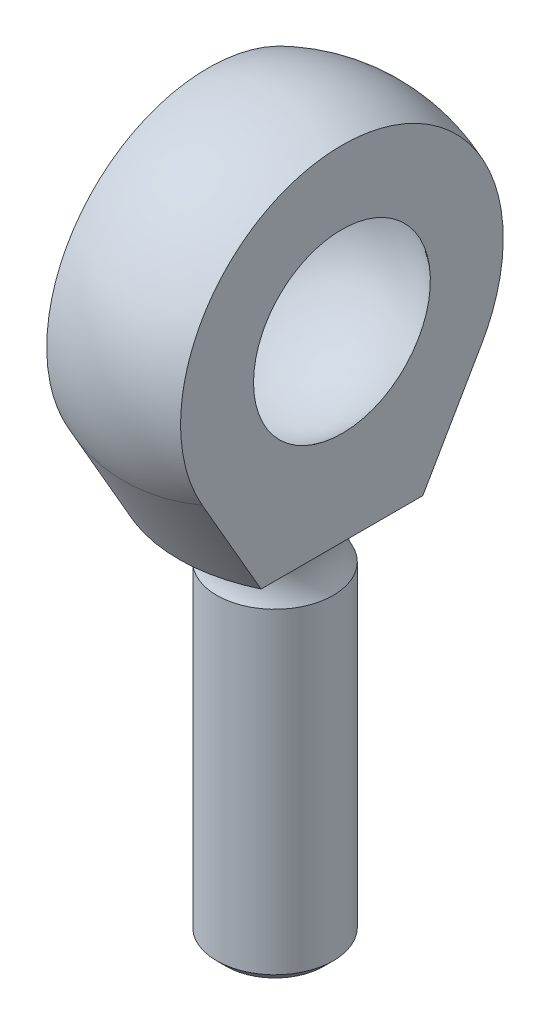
ISO-10303-21;
HEADER;
FILE_DESCRIPTION(('STEP AP214'),'2;1');
FILE_NAME('part.step','',(''),(''),'','','');
FILE_SCHEMA(('AUTOMOTIVE_DESIGN { 1 0 10303 214 1 1 1 1 }'));
ENDSEC;
DATA;
#1=APPLICATION_CONTEXT('core data for automotive mechanical design processes');
#2=APPLICATION_PROTOCOL_DEFINITION('international standard','automotive_design',2000,#1);
#3=PRODUCT_CONTEXT('',#1,'mechanical');
#4=PRODUCT('Part','Part','',(#3));
#5=PRODUCT_RELATED_PRODUCT_CATEGORY('part','',(#4));
#6=PRODUCT_DEFINITION_FORMATION('','',#4);
#7=PRODUCT_DEFINITION_CONTEXT('part definition',#1,'design');
#8=PRODUCT_DEFINITION('design','',#6,#7);
#9=PRODUCT_DEFINITION_SHAPE('','',#8);
#10=(LENGTH_UNIT() NAMED_UNIT(*) SI_UNIT(.MILLI.,.METRE.));
#11=(NAMED_UNIT(*) PLANE_ANGLE_UNIT() SI_UNIT($,.RADIAN.));
#12=(NAMED_UNIT(*) SI_UNIT($,.STERADIAN.) SOLID_ANGLE_UNIT());
#13=UNCERTAINTY_MEASURE_WITH_UNIT(LENGTH_MEASURE(1.E-05),#10,'distance_accuracy_value','');
#14=(GEOMETRIC_REPRESENTATION_CONTEXT(3) GLOBAL_UNCERTAINTY_ASSIGNED_CONTEXT((#13)) GLOBAL_UNIT_ASSIGNED_CONTEXT((#10,
#11,#12)) REPRESENTATION_CONTEXT('',''));
#15=CARTESIAN_POINT('',(0.,0.,0.));
#16=DIRECTION('',(0.,0.,1.));
#17=DIRECTION('',(1.,0.,0.));
#18=AXIS2_PLACEMENT_3D('',#15,#16,#17);
#19=CARTESIAN_POINT('',(2.0940625,-48.,0.));
#20=DIRECTION('',(0.,-1.,0.));
#21=DIRECTION('',(0.,0.,-1.));
#22=AXIS2_PLACEMENT_3D('',#19,#20,#21);
#23=PLANE('',#22);
#24=CARTESIAN_POINT('',(0.,-48.0000000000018,0.));
#25=DIRECTION('',(0.,1.,0.));
#26=DIRECTION('',(0.,0.,1.));
#27=AXIS2_PLACEMENT_3D('',#24,#25,#26);
#28=CIRCLE('',#27,4.18812500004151);
#29=CARTESIAN_POINT('',(0.,-48.0000000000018,4.18812500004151));
#30=VERTEX_POINT('',#29);
#31=EDGE_CURVE('E22',#30,#30,#28,.T.);
#32=ORIENTED_EDGE('',*,*,#31,.F.);
#33=EDGE_LOOP('',(#32));
#34=FACE_BOUND('',#33,.T.);
#35=ADVANCED_FACE('F16',(#34),#23,.T.);
#36=CARTESIAN_POINT('',(0.,-47.1881250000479,0.));
#37=DIRECTION('',(0.,1.,0.));
#38=DIRECTION('',(0.,0.,1.));
#39=AXIS2_PLACEMENT_3D('',#36,#37,#38);
#40=CONICAL_SURFACE('',#39,4.99999999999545,0.785398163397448);
#41=CARTESIAN_POINT('',(0.,-47.188125,0.));
#42=DIRECTION('',(0.,1.,0.));
#43=DIRECTION('',(0.,0.,1.));
#44=AXIS2_PLACEMENT_3D('',#41,#42,#43);
#45=CIRCLE('',#44,5.);
#46=CARTESIAN_POINT('',(0.,-47.188125,5.));
#47=VERTEX_POINT('',#46);
#48=EDGE_CURVE('E87',#47,#47,#45,.T.);
#49=ORIENTED_EDGE('',*,*,#48,.F.);
#50=EDGE_LOOP('',(#49));
#51=FACE_BOUND('',#50,.T.);
#52=ORIENTED_EDGE('',*,*,#31,.T.);
#53=EDGE_LOOP('',(#52));
#54=FACE_BOUND('',#53,.T.);
#55=ADVANCED_FACE('F152',(#51,#54),#40,.T.);
#56=CARTESIAN_POINT('',(0.,-33.5940625,0.));
#57=DIRECTION('',(0.,1.,0.));
#58=DIRECTION('',(0.,0.,1.));
#59=AXIS2_PLACEMENT_3D('',#56,#57,#58);
#60=CYLINDRICAL_SURFACE('',#59,5.);
#61=CARTESIAN_POINT('',(0.,-20.,0.));
#62=DIRECTION('',(0.,1.,0.));
#63=DIRECTION('',(0.,0.,1.));
#64=AXIS2_PLACEMENT_3D('',#61,#62,#63);
#65=CIRCLE('',#64,5.);
#66=CARTESIAN_POINT('',(0.,-20.,5.));
#67=VERTEX_POINT('',#66);
#68=EDGE_CURVE('E89',#67,#67,#65,.T.);
#69=ORIENTED_EDGE('',*,*,#68,.F.);
#70=EDGE_LOOP('',(#69));
#71=FACE_BOUND('',#70,.T.);
#72=ORIENTED_EDGE('',*,*,#48,.T.);
#73=EDGE_LOOP('',(#72));
#74=FACE_BOUND('',#73,.T.);
#75=ADVANCED_FACE('F149',(#71,#74),#60,.T.);
#76=CARTESIAN_POINT('',(0.,-17.84,0.));
#77=DIRECTION('',(0.,1.,0.));
#78=DIRECTION('',(0.,0.,1.));
#79=AXIS2_PLACEMENT_3D('',#76,#77,#78);
#80=TOROIDAL_SURFACE('',#79,8.74122974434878,4.32);
#81=ORIENTED_EDGE('',*,*,#68,.T.);
#82=EDGE_LOOP('',(#81));
#83=FACE_BOUND('',#82,.T.);
#84=CARTESIAN_POINT('',(0.,-15.68,0.));
#85=DIRECTION('',(0.,1.,0.));
#86=DIRECTION('',(0.,0.,1.));
#87=AXIS2_PLACEMENT_3D('',#84,#85,#86);
#88=CIRCLE('',#87,5.);
#89=CARTESIAN_POINT('',(0.,-15.68,5.));
#90=VERTEX_POINT('',#89);
#91=EDGE_CURVE('E68',#90,#90,#88,.T.);
#92=ORIENTED_EDGE('',*,*,#91,.F.);
#93=EDGE_LOOP('',(#92));
#94=FACE_BOUND('',#93,.T.);
#95=ADVANCED_FACE('F146',(#83,#94),#80,.F.);
#96=CARTESIAN_POINT('',(0.,-15.68,0.));
#97=DIRECTION('',(0.,-1.,0.));
#98=DIRECTION('',(0.,0.,-1.));
#99=AXIS2_PLACEMENT_3D('',#96,#97,#98);
#100=PLANE('',#99);
#101=CARTESIAN_POINT('',(0.,-15.68,9.05285222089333));
#102=DIRECTION('',(0.,-1.,0.));
#103=DIRECTION('',(0.,0.,1.));
#104=AXIS2_PLACEMENT_3D('',#101,#102,#103);
#105=ELLIPSE('',#104,17.3205080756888,15.);
#106=CARTESIAN_POINT('',(5.75,-15.68,-6.94454340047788));
#107=VERTEX_POINT('',#106);
#108=CARTESIAN_POINT('',(-5.75,-15.68,-6.94454340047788));
#109=VERTEX_POINT('',#108);
#110=EDGE_CURVE('E67',#107,#109,#105,.F.);
#111=ORIENTED_EDGE('',*,*,#110,.F.);
#112=DIRECTION('',(0.,0.,-1.));
#113=VECTOR('',#112,1.);
#114=CARTESIAN_POINT('',(5.75,-15.68,0.));
#115=LINE('',#114,#113);
#116=CARTESIAN_POINT('',(5.75,-15.68,6.94454340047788));
#117=VERTEX_POINT('',#116);
#118=EDGE_CURVE('E63',#117,#107,#115,.T.);
#119=ORIENTED_EDGE('',*,*,#118,.F.);
#120=CARTESIAN_POINT('',(0.,-15.68,-9.05285222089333));
#121=DIRECTION('',(0.,-1.,0.));
#122=DIRECTION('',(0.,0.,-1.));
#123=AXIS2_PLACEMENT_3D('',#120,#121,#122);
#124=ELLIPSE('',#123,17.3205080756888,15.);
#125=CARTESIAN_POINT('',(-5.75,-15.68,6.94454340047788));
#126=VERTEX_POINT('',#125);
#127=EDGE_CURVE('E55',#126,#117,#124,.F.);
#128=ORIENTED_EDGE('',*,*,#127,.F.);
#129=DIRECTION('',(0.,0.,1.));
#130=VECTOR('',#129,1.);
#131=CARTESIAN_POINT('',(-5.75,-15.68,0.));
#132=LINE('',#131,#130);
#133=EDGE_CURVE('E60',#109,#126,#132,.T.);
#134=ORIENTED_EDGE('',*,*,#133,.F.);
#135=EDGE_LOOP('',(#111,#119,#128,#134));
#136=FACE_BOUND('',#135,.T.);
#137=ORIENTED_EDGE('',*,*,#91,.T.);
#138=EDGE_LOOP('',(#137));
#139=FACE_BOUND('',#138,.T.);
#140=ADVANCED_FACE('F57',(#136,#139),#100,.T.);
#141=CARTESIAN_POINT('',(0.,-6.78963916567,-3.92));
#142=DIRECTION('',(0.,-0.866025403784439,-0.5));
#143=DIRECTION('',(0.,0.5,-0.866025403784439));
#144=AXIS2_PLACEMENT_3D('',#141,#142,#143);
#145=CYLINDRICAL_SURFACE('',#144,15.);
#146=CARTESIAN_POINT('',(0.,0.,0.));
#147=DIRECTION('',(0.,-0.866025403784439,-0.5));
#148=DIRECTION('',(0.,0.5,-0.866025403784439));
#149=AXIS2_PLACEMENT_3D('',#146,#147,#148);
#150=CIRCLE('',#149,15.);
#151=CARTESIAN_POINT('',(-5.75,-6.9270755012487,11.9980467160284));
#152=VERTEX_POINT('',#151);
#153=CARTESIAN_POINT('',(5.75,-6.92707550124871,11.9980467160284));
#154=VERTEX_POINT('',#153);
#155=EDGE_CURVE('E74',#152,#154,#150,.F.);
#156=ORIENTED_EDGE('',*,*,#155,.F.);
#157=DIRECTION('',(0.,0.866025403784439,0.5));
#158=VECTOR('',#157,1.);
#159=CARTESIAN_POINT('',(-5.75,-15.68,6.94454340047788));
#160=LINE('',#159,#158);
#161=EDGE_CURVE('E71',#126,#152,#160,.T.);
#162=ORIENTED_EDGE('',*,*,#161,.F.);
#163=ORIENTED_EDGE('',*,*,#127,.T.);
#164=DIRECTION('',(0.,-0.866025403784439,-0.5));
#165=VECTOR('',#164,1.);
#166=CARTESIAN_POINT('',(5.75,-6.92707550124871,11.9980467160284));
#167=LINE('',#166,#165);
#168=EDGE_CURVE('E128',#154,#117,#167,.T.);
#169=ORIENTED_EDGE('',*,*,#168,.F.);
#170=EDGE_LOOP('',(#156,#162,#163,#169));
#171=FACE_BOUND('',#170,.T.);
#172=ADVANCED_FACE('F72',(#171),#145,.T.);
#173=CARTESIAN_POINT('',(0.,-6.78963916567,3.92));
#174=DIRECTION('',(0.,-0.866025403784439,0.5));
#175=DIRECTION('',(0.,-0.5,-0.866025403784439));
#176=AXIS2_PLACEMENT_3D('',#173,#174,#175);
#177=CYLINDRICAL_SURFACE('',#176,15.);
#178=CARTESIAN_POINT('',(0.,0.,0.));
#179=DIRECTION('',(0.,-0.866025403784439,0.5));
#180=DIRECTION('',(0.,-0.5,-0.866025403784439));
#181=AXIS2_PLACEMENT_3D('',#178,#179,#180);
#182=CIRCLE('',#181,15.);
#183=CARTESIAN_POINT('',(5.75,-6.92707550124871,-11.9980467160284));
#184=VERTEX_POINT('',#183);
#185=CARTESIAN_POINT('',(-5.75,-6.92707550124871,-11.9980467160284));
#186=VERTEX_POINT('',#185);
#187=EDGE_CURVE('E79',#184,#186,#182,.F.);
#188=ORIENTED_EDGE('',*,*,#187,.F.);
#189=DIRECTION('',(0.,0.866025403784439,-0.5));
#190=VECTOR('',#189,1.);
#191=CARTESIAN_POINT('',(5.75,-15.68,-6.94454340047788));
#192=LINE('',#191,#190);
#193=EDGE_CURVE('E86',#107,#184,#192,.T.);
#194=ORIENTED_EDGE('',*,*,#193,.F.);
#195=ORIENTED_EDGE('',*,*,#110,.T.);
#196=DIRECTION('',(0.,-0.866025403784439,0.5));
#197=VECTOR('',#196,1.);
#198=CARTESIAN_POINT('',(-5.75,-6.92707550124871,-11.9980467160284));
#199=LINE('',#198,#197);
#200=EDGE_CURVE('E75',#186,#109,#199,.T.);
#201=ORIENTED_EDGE('',*,*,#200,.F.);
#202=EDGE_LOOP('',(#188,#194,#195,#201));
#203=FACE_BOUND('',#202,.T.);
#204=ADVANCED_FACE('F120',(#203),#177,.T.);
#205=CARTESIAN_POINT('',(0.,0.,0.));
#206=DIRECTION('',(0.636426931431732,0.658308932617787,0.401982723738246));
#207=DIRECTION('',(-0.770138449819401,0.571365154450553,0.28359941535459));
#208=AXIS2_PLACEMENT_3D('',#205,#206,#207);
#209=SPHERICAL_SURFACE('',#208,9.525);
#210=CARTESIAN_POINT('',(-5.75,0.,-7.59362397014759));
#211=CARTESIAN_POINT('',(-5.75,0.213204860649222,-7.59362279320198));
#212=CARTESIAN_POINT('',(-5.75,0.426448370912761,-7.58463728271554));
#213=CARTESIAN_POINT('',(-5.75,0.851465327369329,-7.54875085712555));
#214=CARTESIAN_POINT('',(-5.75,1.0632383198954,-7.52184464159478));
#215=CARTESIAN_POINT('',(-5.75,1.48410868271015,-7.45024684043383));
#216=CARTESIAN_POINT('',(-5.75,1.69320126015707,-7.40552702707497));
#217=CARTESIAN_POINT('',(-5.75,2.10703921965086,-7.29857690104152));
#218=CARTESIAN_POINT('',(-5.75,2.31178092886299,-7.23633238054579));
#219=CARTESIAN_POINT('',(-5.75,2.71493570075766,-7.09491390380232));
#220=CARTESIAN_POINT('',(-5.75,2.91335905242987,-7.01576927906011));
#221=CARTESIAN_POINT('',(-5.75,3.30292331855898,-6.84101005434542));
#222=CARTESIAN_POINT('',(-5.75,3.49406089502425,-6.74538801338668));
#223=CARTESIAN_POINT('',(-5.75,3.8676062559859,-6.53837488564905));
#224=CARTESIAN_POINT('',(-5.75,4.05001371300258,-6.42698320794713));
#225=CARTESIAN_POINT('',(-5.75,4.40471354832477,-6.18927958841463));
#226=CARTESIAN_POINT('',(-5.75,4.57701045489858,-6.06297440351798));
#227=CARTESIAN_POINT('',(-5.75,4.91046183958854,-5.79621483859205));
#228=CARTESIAN_POINT('',(-5.75,5.07160904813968,-5.6557513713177));
#229=CARTESIAN_POINT('',(-5.75,5.38134240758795,-5.36188475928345));
#230=CARTESIAN_POINT('',(-5.75,5.52994051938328,-5.20849422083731));
#231=CARTESIAN_POINT('',(-5.75,5.81375825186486,-4.88967384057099));
#232=CARTESIAN_POINT('',(-5.75,5.94897178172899,-4.72423857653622));
#233=CARTESIAN_POINT('',(-5.75,6.20501227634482,-4.3825265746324));
#234=CARTESIAN_POINT('',(-5.75,6.32583590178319,-4.20624733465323));
#235=CARTESIAN_POINT('',(-5.75,6.55218283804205,-3.84416466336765));
#236=CARTESIAN_POINT('',(-5.75,6.65770859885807,-3.65836276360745));
#237=CARTESIAN_POINT('',(-5.75,6.85273398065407,-3.27852712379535));
#238=CARTESIAN_POINT('',(-5.75,6.94223338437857,-3.0844932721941));
#239=CARTESIAN_POINT('',(-5.75,7.10456609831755,-2.68958018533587));
#240=CARTESIAN_POINT('',(-5.75,7.17739979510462,-2.48870110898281));
#241=CARTESIAN_POINT('',(-5.75,7.30588670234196,-2.08151904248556));
#242=CARTESIAN_POINT('',(-5.75,7.36153971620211,-1.87521599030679));
#243=CARTESIAN_POINT('',(-5.75,7.45525847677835,-1.4586993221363));
#244=CARTESIAN_POINT('',(-5.75,7.49332796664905,-1.24848654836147));
#245=CARTESIAN_POINT('',(-5.75,7.55163903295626,-0.825511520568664));
#246=CARTESIAN_POINT('',(-5.75,7.57187302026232,-0.612748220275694));
#247=CARTESIAN_POINT('',(-5.75,7.59434155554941,-0.18627333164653));
#248=CARTESIAN_POINT('',(-5.75,7.59657610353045,0.0274382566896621));
#249=CARTESIAN_POINT('',(-5.75,7.58303277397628,0.454198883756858));
#250=CARTESIAN_POINT('',(-5.74999999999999,7.56726255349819,0.667248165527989));
#251=CARTESIAN_POINT('',(-5.74999999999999,7.51782891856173,1.09130671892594));
#252=CARTESIAN_POINT('',(-5.75,7.48416169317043,1.30231554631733));
#253=CARTESIAN_POINT('',(-5.75,7.39917153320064,1.72074450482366));
#254=CARTESIAN_POINT('',(-5.75,7.34784880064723,1.92816467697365));
#255=CARTESIAN_POINT('',(-5.75,7.22791101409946,2.3379489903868));
#256=CARTESIAN_POINT('',(-5.75000000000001,7.15929555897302,2.54031301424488));
#257=CARTESIAN_POINT('',(-5.74999999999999,7.00526179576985,2.93853859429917));
#258=CARTESIAN_POINT('',(-5.74999999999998,6.91984371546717,3.13440023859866));
#259=CARTESIAN_POINT('',(-5.74999999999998,6.73279636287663,3.5182623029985));
#260=CARTESIAN_POINT('',(-5.75,6.63116449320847,3.70626145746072));
#261=CARTESIAN_POINT('',(-5.75000000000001,6.41244747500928,4.0729857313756));
#262=CARTESIAN_POINT('',(-5.75,6.29536591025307,4.25171298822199));
#263=CARTESIAN_POINT('',(-5.75,6.04662004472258,4.59859111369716));
#264=CARTESIAN_POINT('',(-5.75000000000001,5.91496237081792,4.76674673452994));
#265=CARTESIAN_POINT('',(-5.74999999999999,5.63782227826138,5.09153236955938));
#266=CARTESIAN_POINT('',(-5.74999999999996,5.49232664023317,5.2481511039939));
#267=CARTESIAN_POINT('',(-5.74999999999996,5.18875149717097,5.5484719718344));
#268=CARTESIAN_POINT('',(-5.74999999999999,5.03068017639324,5.69218237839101));
#269=CARTESIAN_POINT('',(-5.75000000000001,4.70292110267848,5.9658408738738));
#270=CARTESIAN_POINT('',(-5.75,4.53322813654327,6.09578271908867));
#271=CARTESIAN_POINT('',(-5.75,4.183502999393,6.34090085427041));
#272=CARTESIAN_POINT('',(-5.75000000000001,4.00347121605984,6.45607769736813));
#273=CARTESIAN_POINT('',(-5.74999999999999,3.63442670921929,6.67080370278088));
#274=CARTESIAN_POINT('',(-5.74999999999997,3.44541808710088,6.77035991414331));
#275=CARTESIAN_POINT('',(-5.74999999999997,3.05935495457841,6.95335779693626));
#276=CARTESIAN_POINT('',(-5.74999999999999,2.86228712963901,7.03677137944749));
#277=CARTESIAN_POINT('',(-5.75000000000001,2.46197813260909,7.18661427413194));
#278=CARTESIAN_POINT('',(-5.75,2.25874210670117,7.25305733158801));
#279=CARTESIAN_POINT('',(-5.75,1.84772499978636,7.36848253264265));
#280=CARTESIAN_POINT('',(-5.75000000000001,1.63995165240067,7.41749224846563));
#281=CARTESIAN_POINT('',(-5.75,1.22105838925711,7.49783951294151));
#282=CARTESIAN_POINT('',(-5.74999999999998,1.00993947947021,7.52918227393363));
#283=CARTESIAN_POINT('',(-5.74999999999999,0.665410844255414,7.56558774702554));
#284=CARTESIAN_POINT('',(-5.75,0.532553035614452,7.57609804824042));
#285=CARTESIAN_POINT('',(-5.75000000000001,0.266468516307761,7.59011652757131));
#286=CARTESIAN_POINT('',(-5.75,0.133241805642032,7.59362470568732));
#287=CARTESIAN_POINT('',(-5.75,-0.213204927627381,7.59362279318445));
#288=CARTESIAN_POINT('',(-5.75,-0.426448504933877,7.5846372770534));
#289=CARTESIAN_POINT('',(-5.75,-0.85146546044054,7.54875084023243));
#290=CARTESIAN_POINT('',(-5.75,-1.06323838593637,7.5218446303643));
#291=CARTESIAN_POINT('',(-5.75,-1.48410866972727,7.45024684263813));
#292=CARTESIAN_POINT('',(-5.75,-1.69320123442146,7.40552703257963));
#293=CARTESIAN_POINT('',(-5.75,-2.10703919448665,7.29857690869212));
#294=CARTESIAN_POINT('',(-5.75,-2.31178091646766,7.23633238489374));
#295=CARTESIAN_POINT('',(-5.75,-2.7149357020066,7.0949139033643));
#296=CARTESIAN_POINT('',(-5.75,-2.91335905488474,7.01576927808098));
#297=CARTESIAN_POINT('',(-5.75,-3.30292332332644,6.84101005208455));
#298=CARTESIAN_POINT('',(-5.75,-3.49406090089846,6.74538801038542));
#299=CARTESIAN_POINT('',(-5.75,-3.86760626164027,6.53837488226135));
#300=CARTESIAN_POINT('',(-5.75,-4.05001371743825,6.42698320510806));
#301=CARTESIAN_POINT('',(-5.75,-4.40471355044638,6.18927958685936));
#302=CARTESIAN_POINT('',(-5.75,-4.57701045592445,6.06297440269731));
#303=CARTESIAN_POINT('',(-5.75,-4.91046184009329,5.79621483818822));
#304=CARTESIAN_POINT('',(-5.75,-5.07160904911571,5.65575137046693));
#305=CARTESIAN_POINT('',(-5.75,-5.38134240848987,5.36188475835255));
#306=CARTESIAN_POINT('',(-5.75,-5.52994051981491,5.20849422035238));
#307=CARTESIAN_POINT('',(-5.75,-5.81375824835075,4.88967384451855));
#308=CARTESIAN_POINT('',(-5.75,-5.94897177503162,4.72423858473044));
#309=CARTESIAN_POINT('',(-5.75,-6.20501227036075,4.38252658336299));
#310=CARTESIAN_POINT('',(-5.75,-6.32583589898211,4.20624733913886));
#311=CARTESIAN_POINT('',(-5.75,-6.55218284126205,3.84416465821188));
#312=CARTESIAN_POINT('',(-5.75,-6.65770860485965,3.65836275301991));
#313=CARTESIAN_POINT('',(-5.75,-6.85273398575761,3.27852711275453));
#314=CARTESIAN_POINT('',(-5.75,-6.94223338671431,3.08449326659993));
#315=CARTESIAN_POINT('',(-5.75,-7.10456602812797,2.68958035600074));
#316=CARTESIAN_POINT('',(-5.75,-7.17739966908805,2.48870145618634));
#317=CARTESIAN_POINT('',(-5.75,-7.30588660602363,2.08151939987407));
#318=CARTESIAN_POINT('',(-5.75,-7.36153967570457,1.87521617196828));
#319=CARTESIAN_POINT('',(-5.75,-7.45525837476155,1.45869977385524));
#320=CARTESIAN_POINT('',(-5.75,-7.49332780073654,1.24848745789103));
#321=CARTESIAN_POINT('',(-5.75,-7.55163894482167,0.825512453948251));
#322=CARTESIAN_POINT('',(-5.75,-7.57187299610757,0.612748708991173));
#323=CARTESIAN_POINT('',(-5.75,-7.59434166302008,0.186271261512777));
#324=CARTESIAN_POINT('',(-5.75,-7.59657614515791,-0.0274424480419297));
#325=CARTESIAN_POINT('',(-5.75,-7.58303247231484,-0.454202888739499));
#326=CARTESIAN_POINT('',(-5.75000000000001,-7.5672623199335,-0.667249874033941));
#327=CARTESIAN_POINT('',(-5.75000000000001,-7.51782702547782,-1.09132325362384));
#328=CARTESIAN_POINT('',(-5.75,-7.48415653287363,-1.3023490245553));
#329=CARTESIAN_POINT('',(-5.75,-7.39916368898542,-1.72077505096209));
#330=CARTESIAN_POINT('',(-5.75,-7.34784423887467,-1.92817589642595));
#331=CARTESIAN_POINT('',(-5.75,-7.22793155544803,-2.33788317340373));
#332=CARTESIAN_POINT('',(-5.75,-7.15934252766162,-2.54019083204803));
#333=CARTESIAN_POINT('',(-5.75,-7.04384418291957,-2.83879138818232));
#334=CARTESIAN_POINT('',(-5.75,-7.00322966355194,-2.93754061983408));
#335=CARTESIAN_POINT('',(-5.75,-6.91790158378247,-3.13325875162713));
#336=CARTESIAN_POINT('',(-5.75,-6.87318511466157,-3.23022632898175));
#337=CARTESIAN_POINT('',(-5.75,-6.45347509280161,-4.0909142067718));
#338=CARTESIAN_POINT('',(-5.75,-5.94505596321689,-4.79991951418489));
#339=CARTESIAN_POINT('',(-5.75,-5.26442951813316,-5.47364992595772));
#340=CARTESIAN_POINT('',(-5.75,-5.18684714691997,-5.54718978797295));
#341=CARTESIAN_POINT('',(-5.75,-5.02868206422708,-5.69093564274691));
#342=CARTESIAN_POINT('',(-5.75,-4.94810199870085,-5.76114445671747));
#343=CARTESIAN_POINT('',(-5.75,-4.70213157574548,-5.96647100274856));
#344=CARTESIAN_POINT('',(-5.75,-4.53239040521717,-6.09640812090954));
#345=CARTESIAN_POINT('',(-5.75,-4.18277769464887,-6.34137082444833));
#346=CARTESIAN_POINT('',(-5.75,-4.00291800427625,-6.45641335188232));
#347=CARTESIAN_POINT('',(-5.75,-3.63417269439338,-6.67093770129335));
#348=CARTESIAN_POINT('',(-5.75,-3.4452882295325,-6.77042150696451));
#349=CARTESIAN_POINT('',(-5.75,-3.05938200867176,-6.95334493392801));
#350=CARTESIAN_POINT('',(-5.75,-2.86234283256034,-7.03674779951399));
#351=CARTESIAN_POINT('',(-5.75,-2.46203577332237,-7.18659542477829));
#352=CARTESIAN_POINT('',(-5.75,-2.25877124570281,-7.25304914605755));
#353=CARTESIAN_POINT('',(-5.75,-1.84771915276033,-7.36848417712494));
#354=CARTESIAN_POINT('',(-5.75,-1.63993987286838,-7.41749502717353));
#355=CARTESIAN_POINT('',(-5.75,-1.2210464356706,-7.49784128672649));
#356=CARTESIAN_POINT('',(-5.75,-1.00993347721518,-7.52918290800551));
#357=CARTESIAN_POINT('',(-5.75,-0.665410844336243,-7.56558774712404));
#358=CARTESIAN_POINT('',(-5.75,-0.532553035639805,-7.57609804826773));
#359=CARTESIAN_POINT('',(-5.75,-0.266468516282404,-7.59011652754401));
#360=CARTESIAN_POINT('',(-5.75,-0.133241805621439,-7.5936247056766));
#361=CARTESIAN_POINT('',(-5.75,0.,-7.59362397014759));
#362=B_SPLINE_CURVE_WITH_KNOTS('',3,(#210,#211,#212,#213,#214,#215,#216,#217,#218,#219,#220,
#221,#222,#223,#224,#225,#226,#227,#228,#229,#230,#231,#232,#233,#234,#235,#236,#237,#238,#239,
#240,#241,#242,#243,#244,#245,#246,#247,#248,#249,#250,#251,#252,#253,#254,#255,#256,#257,#258,
#259,#260,#261,#262,#263,#264,#265,#266,#267,#268,#269,#270,#271,#272,#273,#274,#275,#276,#277,
#278,#279,#280,#281,#282,#283,#284,#285,#286,#287,#288,#289,#290,#291,#292,#293,#294,#295,#296,
#297,#298,#299,#300,#301,#302,#303,#304,#305,#306,#307,#308,#309,#310,#311,#312,#313,#314,#315,
#316,#317,#318,#319,#320,#321,#322,#323,#324,#325,#326,#327,#328,#329,#330,#331,#332,#333,#334,
#335,#336,#337,#338,#339,#340,#341,#342,#343,#344,#345,#346,#347,#348,#349,#350,#351,#352,#353,
#354,#355,#356,#357,#358,#359,#360,#361),.UNSPECIFIED.,.T.,.F.,(4,2,2,2,2,2,2,2,2,2,2,2,2,2,2,2,
2,2,2,2,2,2,2,2,2,2,2,2,2,2,2,2,2,2,2,2,2,2,2,2,2,2,2,2,2,2,2,2,2,2,2,2,2,2,2,2,2,2,2,2,2,2,2,2,
2,2,2,2,2,2,2,2,2,2,2,4),(0.,0.639492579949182,1.27917438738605,1.91987390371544,
2.56109435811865,3.20121083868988,3.84161714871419,4.48204746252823,5.12218871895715,
5.76274348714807,6.40268066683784,7.04290773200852,7.68328307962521,8.32355575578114,
8.96383711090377,9.60410361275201,10.2443774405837,10.8845149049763,11.5249246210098,
12.1653343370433,12.8054718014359,13.445745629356,14.0860121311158,14.7262934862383,
15.3665661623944,16.0069415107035,16.6471685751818,17.2871057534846,17.9276605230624,
18.5678017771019,19.2082320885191,19.8486384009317,20.4887548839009,21.1299753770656,
21.7706748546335,22.4103564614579,23.0498492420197,23.4494984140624,23.8491475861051,
24.4886403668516,25.1283219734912,25.7690214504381,26.4102419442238,27.0503584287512,
27.6907647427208,28.3311950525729,28.9713363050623,29.6118910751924,30.251828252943,
30.8920553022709,31.5324306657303,32.1727033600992,32.8129846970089,33.4532506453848,
34.0935250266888,34.7336610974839,35.3740722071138,36.0144880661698,36.6546193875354,
37.2949421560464,37.9351597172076,38.5752215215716,38.8954244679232,39.2158562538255,
41.7655777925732,42.086358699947,42.4068628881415,43.047364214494,43.6871304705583,
44.3268150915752,44.9679449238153,45.6087350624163,46.2484347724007,46.8879094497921,
47.2875586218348,47.6872077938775),.UNSPECIFIED.);
#363=CARTESIAN_POINT('',(-5.75,0.,-7.59362397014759));
#364=VERTEX_POINT('',#363);
#365=EDGE_CURVE('E106',#364,#364,#362,.T.);
#366=ORIENTED_EDGE('',*,*,#365,.F.);
#367=EDGE_LOOP('',(#366));
#368=FACE_BOUND('',#367,.T.);
#369=CARTESIAN_POINT('',(5.75,0.,7.59362397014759));
#370=CARTESIAN_POINT('',(5.75,0.213204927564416,7.59362279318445));
#371=CARTESIAN_POINT('',(5.75,0.426448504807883,7.58463727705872));
#372=CARTESIAN_POINT('',(5.75,0.851465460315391,7.54875084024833));
#373=CARTESIAN_POINT('',(5.75,1.06323838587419,7.52184463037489));
#374=CARTESIAN_POINT('',(5.75,1.48410866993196,7.4502468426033));
#375=CARTESIAN_POINT('',(5.75,1.69320123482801,7.40552703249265));
#376=CARTESIAN_POINT('',(5.75,2.10703919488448,7.2985769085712));
#377=CARTESIAN_POINT('',(5.75,2.3117809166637,7.23633238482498));
#378=CARTESIAN_POINT('',(5.75,2.71493570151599,7.09491390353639));
#379=CARTESIAN_POINT('',(5.75,2.91335905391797,7.0157692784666));
#380=CARTESIAN_POINT('',(5.75,3.30292332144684,6.84101005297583));
#381=CARTESIAN_POINT('',(5.75,3.49406089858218,6.74538801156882));
#382=CARTESIAN_POINT('',(5.75,3.86760625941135,6.53837488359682));
#383=CARTESIAN_POINT('',(5.75,4.05001371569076,6.4269832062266));
#384=CARTESIAN_POINT('',(5.75,4.4047135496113,6.18927958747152));
#385=CARTESIAN_POINT('',(5.75,4.57701045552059,6.06297440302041));
#386=CARTESIAN_POINT('',(5.75,4.9104618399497,5.79621483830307));
#387=CARTESIAN_POINT('',(5.75,5.07160904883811,5.65575137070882));
#388=CARTESIAN_POINT('',(5.75,5.38134240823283,5.36188475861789));
#389=CARTESIAN_POINT('',(5.75,5.52994051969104,5.20849422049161));
#390=CARTESIAN_POINT('',(5.75,5.81375825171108,4.88967384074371));
#391=CARTESIAN_POINT('',(5.75,5.94897178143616,4.72423857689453));
#392=CARTESIAN_POINT('',(5.75,6.20501227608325,4.38252657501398));
#393=CARTESIAN_POINT('',(5.75,6.32583590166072,4.20624733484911));
#394=CARTESIAN_POINT('',(5.75,6.55218283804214,3.84416466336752));
#395=CARTESIAN_POINT('',(5.75,6.65770859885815,3.65836276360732));
#396=CARTESIAN_POINT('',(5.75,6.85273398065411,3.27852712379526));
#397=CARTESIAN_POINT('',(5.75,6.94223338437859,3.08449327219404));
#398=CARTESIAN_POINT('',(5.75,7.10456609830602,2.68958018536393));
#399=CARTESIAN_POINT('',(5.75,7.17739979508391,2.48870110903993));
#400=CARTESIAN_POINT('',(5.75,7.30588670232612,2.08151904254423));
#401=CARTESIAN_POINT('',(5.75,7.36153971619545,1.8752159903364));
#402=CARTESIAN_POINT('',(5.75,7.45525847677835,1.45869932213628));
#403=CARTESIAN_POINT('',(5.75,7.49332796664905,1.24848654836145));
#404=CARTESIAN_POINT('',(5.75,7.55163903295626,0.825511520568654));
#405=CARTESIAN_POINT('',(5.75,7.57187302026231,0.612748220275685));
#406=CARTESIAN_POINT('',(5.75,7.59434155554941,0.186273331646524));
#407=CARTESIAN_POINT('',(5.75,7.59657610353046,-0.0274382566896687));
#408=CARTESIAN_POINT('',(5.75,7.58303277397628,-0.454198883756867));
#409=CARTESIAN_POINT('',(5.75,7.56726255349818,-0.667248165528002));
#410=CARTESIAN_POINT('',(5.75,7.51782891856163,-1.0913067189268));
#411=CARTESIAN_POINT('',(5.75,7.48416169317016,-1.30231554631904));
#412=CARTESIAN_POINT('',(5.75,7.39917153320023,-1.72074450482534));
#413=CARTESIAN_POINT('',(5.75,7.34784880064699,-1.92816467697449));
#414=CARTESIAN_POINT('',(5.75,7.22791101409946,-2.33794899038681));
#415=CARTESIAN_POINT('',(5.75,7.15929555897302,-2.54031301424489));
#416=CARTESIAN_POINT('',(5.75,7.00526179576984,-2.93853859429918));
#417=CARTESIAN_POINT('',(5.75,6.91984371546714,-3.13440023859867));
#418=CARTESIAN_POINT('',(5.75,6.73279636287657,-3.51826230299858));
#419=CARTESIAN_POINT('',(5.75,6.63116449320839,-3.70626145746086));
#420=CARTESIAN_POINT('',(5.75,6.41244747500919,-4.07298573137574));
#421=CARTESIAN_POINT('',(5.75,6.29536591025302,-4.25171298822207));
#422=CARTESIAN_POINT('',(5.75,6.04662004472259,-4.59859111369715));
#423=CARTESIAN_POINT('',(5.75,5.91496237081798,-4.76674673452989));
#424=CARTESIAN_POINT('',(5.75,5.63782227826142,-5.09153236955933));
#425=CARTESIAN_POINT('',(5.75,5.49232664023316,-5.24815110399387));
#426=CARTESIAN_POINT('',(5.75,5.18875149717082,-5.5484719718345));
#427=CARTESIAN_POINT('',(5.75,5.03068017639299,-5.69218237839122));
#428=CARTESIAN_POINT('',(5.75,4.70292110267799,-5.9658408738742));
#429=CARTESIAN_POINT('',(5.75,4.53322813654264,-6.09578271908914));
#430=CARTESIAN_POINT('',(5.75,4.18350299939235,-6.34090085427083));
#431=CARTESIAN_POINT('',(5.75,4.0034712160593,-6.45607769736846));
#432=CARTESIAN_POINT('',(5.75,3.634426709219,-6.67080370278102));
#433=CARTESIAN_POINT('',(5.75,3.44541808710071,-6.77035991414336));
#434=CARTESIAN_POINT('',(5.75,3.05935495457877,-6.95335779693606));
#435=CARTESIAN_POINT('',(5.75,2.86228712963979,-7.03677137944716));
#436=CARTESIAN_POINT('',(5.75,2.4619781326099,-7.18661427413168));
#437=CARTESIAN_POINT('',(5.75,2.25874210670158,-7.2530573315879));
#438=CARTESIAN_POINT('',(5.75,1.84772499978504,-7.36848253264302));
#439=CARTESIAN_POINT('',(5.75,1.63995165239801,-7.41749224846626));
#440=CARTESIAN_POINT('',(5.75,1.2210583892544,-7.49783951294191));
#441=CARTESIAN_POINT('',(5.75,1.00993947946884,-7.52918227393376));
#442=CARTESIAN_POINT('',(5.75,0.665410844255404,-7.56558774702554));
#443=CARTESIAN_POINT('',(5.75,0.532553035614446,-7.57609804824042));
#444=CARTESIAN_POINT('',(5.75,0.266468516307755,-7.59011652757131));
#445=CARTESIAN_POINT('',(5.75,0.133241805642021,-7.59362470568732));
#446=CARTESIAN_POINT('',(5.75,-0.213204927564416,-7.59362279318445));
#447=CARTESIAN_POINT('',(5.75,-0.426448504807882,-7.58463727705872));
#448=CARTESIAN_POINT('',(5.75,-0.851465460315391,-7.54875084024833));
#449=CARTESIAN_POINT('',(5.75,-1.06323838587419,-7.52184463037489));
#450=CARTESIAN_POINT('',(5.75,-1.48410866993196,-7.4502468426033));
#451=CARTESIAN_POINT('',(5.75,-1.69320123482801,-7.40552703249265));
#452=CARTESIAN_POINT('',(5.75,-2.10703919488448,-7.2985769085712));
#453=CARTESIAN_POINT('',(5.75,-2.3117809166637,-7.23633238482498));
#454=CARTESIAN_POINT('',(5.75,-2.71493570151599,-7.09491390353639));
#455=CARTESIAN_POINT('',(5.75,-2.91335905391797,-7.0157692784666));
#456=CARTESIAN_POINT('',(5.75,-3.30292332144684,-6.84101005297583));
#457=CARTESIAN_POINT('',(5.75,-3.49406089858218,-6.74538801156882));
#458=CARTESIAN_POINT('',(5.75,-3.86760625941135,-6.53837488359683));
#459=CARTESIAN_POINT('',(5.75,-4.05001371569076,-6.4269832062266));
#460=CARTESIAN_POINT('',(5.75,-4.40471354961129,-6.18927958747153));
#461=CARTESIAN_POINT('',(5.74999999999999,-4.5770104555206,-6.06297440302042));
#462=CARTESIAN_POINT('',(5.74999999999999,-4.9104618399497,-5.79621483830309));
#463=CARTESIAN_POINT('',(5.75,-5.07160904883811,-5.65575137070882));
#464=CARTESIAN_POINT('',(5.75,-5.38134240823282,-5.3618847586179));
#465=CARTESIAN_POINT('',(5.75,-5.52994051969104,-5.20849422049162));
#466=CARTESIAN_POINT('',(5.75,-5.81375825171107,-4.88967384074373));
#467=CARTESIAN_POINT('',(5.75000000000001,-5.94897178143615,-4.72423857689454));
#468=CARTESIAN_POINT('',(5.74999999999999,-6.20501227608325,-4.38252657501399));
#469=CARTESIAN_POINT('',(5.74999999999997,-6.32583590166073,-4.20624733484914));
#470=CARTESIAN_POINT('',(5.74999999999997,-6.55218283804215,-3.84416466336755));
#471=CARTESIAN_POINT('',(5.74999999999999,-6.65770859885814,-3.65836276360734));
#472=CARTESIAN_POINT('',(5.75000000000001,-6.8527339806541,-3.27852712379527));
#473=CARTESIAN_POINT('',(5.75,-6.94223338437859,-3.08449327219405));
#474=CARTESIAN_POINT('',(5.75,-7.10456609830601,-2.68958018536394));
#475=CARTESIAN_POINT('',(5.75000000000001,-7.1773997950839,-2.48870110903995));
#476=CARTESIAN_POINT('',(5.74999999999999,-7.30588670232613,-2.08151904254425));
#477=CARTESIAN_POINT('',(5.74999999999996,-7.36153971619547,-1.87521599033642));
#478=CARTESIAN_POINT('',(5.74999999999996,-7.45525847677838,-1.45869932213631));
#479=CARTESIAN_POINT('',(5.74999999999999,-7.49332796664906,-1.24848654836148));
#480=CARTESIAN_POINT('',(5.75000000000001,-7.55163903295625,-0.825511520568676));
#481=CARTESIAN_POINT('',(5.75,-7.57187302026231,-0.612748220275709));
#482=CARTESIAN_POINT('',(5.75,-7.59434155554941,-0.186273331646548));
#483=CARTESIAN_POINT('',(5.75000000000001,-7.59657610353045,0.0274382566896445));
#484=CARTESIAN_POINT('',(5.74999999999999,-7.58303277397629,0.454198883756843));
#485=CARTESIAN_POINT('',(5.74999999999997,-7.56726255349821,0.667248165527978));
#486=CARTESIAN_POINT('',(5.74999999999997,-7.51782891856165,1.09130671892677));
#487=CARTESIAN_POINT('',(5.74999999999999,-7.48416169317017,1.30231554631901));
#488=CARTESIAN_POINT('',(5.75000000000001,-7.39917153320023,1.72074450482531));
#489=CARTESIAN_POINT('',(5.75,-7.34784880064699,1.92816467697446));
#490=CARTESIAN_POINT('',(5.75,-7.22791101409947,2.33794899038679));
#491=CARTESIAN_POINT('',(5.75,-7.15929555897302,2.54031301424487));
#492=CARTESIAN_POINT('',(5.75,-7.00526179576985,2.93853859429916));
#493=CARTESIAN_POINT('',(5.74999999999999,-6.91984371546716,3.13440023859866));
#494=CARTESIAN_POINT('',(5.74999999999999,-6.73279636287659,3.51826230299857));
#495=CARTESIAN_POINT('',(5.75,-6.6311644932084,3.70626145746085));
#496=CARTESIAN_POINT('',(5.75,-6.4124474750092,4.07298573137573));
#497=CARTESIAN_POINT('',(5.75,-6.29536591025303,4.25171298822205));
#498=CARTESIAN_POINT('',(5.75,-6.0466200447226,4.59859111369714));
#499=CARTESIAN_POINT('',(5.75,-5.91496237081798,4.76674673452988));
#500=CARTESIAN_POINT('',(5.75,-5.63782227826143,5.09153236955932));
#501=CARTESIAN_POINT('',(5.75,-5.49232664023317,5.24815110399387));
#502=CARTESIAN_POINT('',(5.75,-5.18875149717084,5.5484719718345));
#503=CARTESIAN_POINT('',(5.75,-5.030680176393,5.69218237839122));
#504=CARTESIAN_POINT('',(5.75,-4.702921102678,5.96584087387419));
#505=CARTESIAN_POINT('',(5.75,-4.53322813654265,6.09578271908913));
#506=CARTESIAN_POINT('',(5.75,-4.18350299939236,6.34090085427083));
#507=CARTESIAN_POINT('',(5.75,-4.00347121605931,6.45607769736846));
#508=CARTESIAN_POINT('',(5.75,-3.63442670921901,6.67080370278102));
#509=CARTESIAN_POINT('',(5.75,-3.44541808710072,6.77035991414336));
#510=CARTESIAN_POINT('',(5.75,-3.05935495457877,6.95335779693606));
#511=CARTESIAN_POINT('',(5.75,-2.8622871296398,7.03677137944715));
#512=CARTESIAN_POINT('',(5.75,-2.46197813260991,7.18661427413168));
#513=CARTESIAN_POINT('',(5.75,-2.25874210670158,7.2530573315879));
#514=CARTESIAN_POINT('',(5.75,-1.84772499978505,7.36848253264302));
#515=CARTESIAN_POINT('',(5.75,-1.63995165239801,7.41749224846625));
#516=CARTESIAN_POINT('',(5.75,-1.22105838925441,7.49783951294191));
#517=CARTESIAN_POINT('',(5.75,-1.00993947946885,7.52918227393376));
#518=CARTESIAN_POINT('',(5.75,-0.665410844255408,7.56558774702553));
#519=CARTESIAN_POINT('',(5.75,-0.53255303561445,7.57609804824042));
#520=CARTESIAN_POINT('',(5.75,-0.266468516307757,7.59011652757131));
#521=CARTESIAN_POINT('',(5.75,-0.133241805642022,7.59362470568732));
#522=CARTESIAN_POINT('',(5.75,0.,7.59362397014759));
#523=B_SPLINE_CURVE_WITH_KNOTS('',3,(#369,#370,#371,#372,#373,#374,#375,#376,#377,#378,#379,
#380,#381,#382,#383,#384,#385,#386,#387,#388,#389,#390,#391,#392,#393,#394,#395,#396,#397,#398,
#399,#400,#401,#402,#403,#404,#405,#406,#407,#408,#409,#410,#411,#412,#413,#414,#415,#416,#417,
#418,#419,#420,#421,#422,#423,#424,#425,#426,#427,#428,#429,#430,#431,#432,#433,#434,#435,#436,
#437,#438,#439,#440,#441,#442,#443,#444,#445,#446,#447,#448,#449,#450,#451,#452,#453,#454,#455,
#456,#457,#458,#459,#460,#461,#462,#463,#464,#465,#466,#467,#468,#469,#470,#471,#472,#473,#474,
#475,#476,#477,#478,#479,#480,#481,#482,#483,#484,#485,#486,#487,#488,#489,#490,#491,#492,#493,
#494,#495,#496,#497,#498,#499,#500,#501,#502,#503,#504,#505,#506,#507,#508,#509,#510,#511,#512,
#513,#514,#515,#516,#517,#518,#519,#520,#521,#522),.UNSPECIFIED.,.T.,.F.,(4,2,2,2,2,2,2,2,2,2,2,
2,2,2,2,2,2,2,2,2,2,2,2,2,2,2,2,2,2,2,2,2,2,2,2,2,2,2,2,2,2,2,2,2,2,2,2,2,2,2,2,2,2,2,2,2,2,2,2,
2,2,2,2,2,2,2,2,2,2,2,2,2,2,2,2,2,4),(0.,0.639492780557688,1.27917438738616,1.9198738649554,
2.5610943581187,3.20121084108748,3.84161715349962,4.48204746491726,5.12218871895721,
5.76274348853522,6.4026806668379,7.04290773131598,7.68328307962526,8.32355575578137,
8.96383711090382,9.6041036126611,10.2443774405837,10.8845149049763,11.5249246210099,
12.1653343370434,12.805471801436,13.4457456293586,14.0860121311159,14.7262934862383,
15.3665661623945,16.0069415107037,16.6471685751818,17.2871057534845,17.9276605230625,
18.5678017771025,19.2082320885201,19.8486384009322,20.488754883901,21.1299753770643,
21.7706748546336,22.410356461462,23.0498492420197,23.4494984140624,23.8491475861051,
24.4886403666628,25.1283219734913,25.7690214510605,26.4102419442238,27.0503584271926,
27.6907647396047,28.3311950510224,28.9713363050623,29.6118910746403,30.251828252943,
30.8920553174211,31.5324306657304,32.1727033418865,32.8129846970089,33.4532511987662,
34.0935250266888,34.7336624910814,35.374072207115,36.0144819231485,36.6546193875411,
37.2948932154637,37.935159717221,38.5754410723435,39.2157137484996,39.8560890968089,
40.4963161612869,41.1362533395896,41.7768081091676,42.4169493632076,43.0573796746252,
43.6977859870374,44.3379024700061,44.9791229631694,45.6198224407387,46.2595040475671,
46.8989968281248,47.2986460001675,47.6982951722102),.UNSPECIFIED.);
#524=CARTESIAN_POINT('',(5.75,0.,7.59362397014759));
#525=VERTEX_POINT('',#524);
#526=EDGE_CURVE('E81',#525,#525,#523,.T.);
#527=ORIENTED_EDGE('',*,*,#526,.F.);
#528=EDGE_LOOP('',(#527));
#529=FACE_BOUND('',#528,.T.);
#530=ADVANCED_FACE('F115',(#368,#529),#209,.F.);
#531=CARTESIAN_POINT('',(5.75,0.,0.));
#532=DIRECTION('',(1.,0.,0.));
#533=DIRECTION('',(0.,0.,-1.));
#534=AXIS2_PLACEMENT_3D('',#531,#532,#533);
#535=PLANE('',#534);
#536=ORIENTED_EDGE('',*,*,#526,.T.);
#537=EDGE_LOOP('',(#536));
#538=FACE_BOUND('',#537,.T.);
#539=CARTESIAN_POINT('',(5.74999999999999,-6.92707550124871,11.9980467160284));
#540=CARTESIAN_POINT('',(5.75,-6.58899428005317,12.1932865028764));
#541=CARTESIAN_POINT('',(5.75,-6.24262629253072,12.3741603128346));
#542=CARTESIAN_POINT('',(5.75,-5.53575669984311,12.7061047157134));
#543=CARTESIAN_POINT('',(5.75,-5.17525064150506,12.8571658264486));
#544=CARTESIAN_POINT('',(5.75,-4.44456314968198,13.1276217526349));
#545=CARTESIAN_POINT('',(5.75,-4.07443798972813,13.2471685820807));
#546=CARTESIAN_POINT('',(5.75,-3.32561079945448,13.4546904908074));
#547=CARTESIAN_POINT('',(5.75,-2.94691226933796,13.5426782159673));
#548=CARTESIAN_POINT('',(5.75,-2.14275398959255,13.6941902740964));
#549=CARTESIAN_POINT('',(5.75,-1.71661058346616,13.7541098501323));
#550=CARTESIAN_POINT('',(5.75,-0.860305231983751,13.8341033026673));
#551=CARTESIAN_POINT('',(5.75,-0.430140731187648,13.8541498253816));
#552=CARTESIAN_POINT('',(5.75,0.389200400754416,13.8541520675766));
#553=CARTESIAN_POINT('',(5.75,0.778381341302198,13.8377419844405));
#554=CARTESIAN_POINT('',(5.75,1.55411419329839,13.7722102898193));
#555=CARTESIAN_POINT('',(5.75,1.9406652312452,13.7230782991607));
#556=CARTESIAN_POINT('',(5.75,2.70867866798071,13.5923679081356));
#557=CARTESIAN_POINT('',(5.75,3.09013497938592,13.5107537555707));
#558=CARTESIAN_POINT('',(5.75,3.84481040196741,13.3156610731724));
#559=CARTESIAN_POINT('',(5.75,4.21802952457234,13.2021825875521));
#560=CARTESIAN_POINT('',(5.75,4.95338905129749,12.9442336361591));
#561=CARTESIAN_POINT('',(5.75,5.31553491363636,12.7997787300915));
#562=CARTESIAN_POINT('',(5.75,6.02637521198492,12.4808675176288));
#563=CARTESIAN_POINT('',(5.75,6.37506938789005,12.306410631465));
#564=CARTESIAN_POINT('',(5.75,7.05642240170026,11.9287916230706));
#565=CARTESIAN_POINT('',(5.75,7.38908575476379,11.7256376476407));
#566=CARTESIAN_POINT('',(5.75,8.03611689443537,11.292032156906));
#567=CARTESIAN_POINT('',(5.75,8.35048476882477,11.0615807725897));
#568=CARTESIAN_POINT('',(5.75,8.95872732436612,10.5749895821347));
#569=CARTESIAN_POINT('',(5.75,9.25259964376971,10.3188468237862));
#570=CARTESIAN_POINT('',(5.75,9.81772254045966,9.78271559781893));
#571=CARTESIAN_POINT('',(5.75,10.0889730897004,9.50272710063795));
#572=CARTESIAN_POINT('',(5.75,10.6069364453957,8.92088081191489));
#573=CARTESIAN_POINT('',(5.75,10.8536480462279,8.61902194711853));
#574=CARTESIAN_POINT('',(5.75,11.32076424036,7.99559329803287));
#575=CARTESIAN_POINT('',(5.75,11.5411688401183,7.67402351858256));
#576=CARTESIAN_POINT('',(5.75,11.9540996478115,7.01346635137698));
#577=CARTESIAN_POINT('',(5.75,12.1466264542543,6.6744793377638));
#578=CARTESIAN_POINT('',(5.75,12.5024385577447,5.98149134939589));
#579=CARTESIAN_POINT('',(5.75,12.6657238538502,5.62749037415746));
#580=CARTESIAN_POINT('',(5.75,12.9618911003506,4.90699356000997));
#581=CARTESIAN_POINT('',(5.75,13.0947732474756,4.54049780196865));
#582=CARTESIAN_POINT('',(5.75,13.3291908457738,3.79761479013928));
#583=CARTESIAN_POINT('',(5.75,13.430726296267,3.42122753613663));
#584=CARTESIAN_POINT('',(5.75,13.6017289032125,2.66123626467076));
#585=CARTESIAN_POINT('',(5.75,13.6711959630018,2.27763222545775));
#586=CARTESIAN_POINT('',(5.75,13.7775674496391,1.50593581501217));
#587=CARTESIAN_POINT('',(5.75,13.8144718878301,1.11784344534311));
#588=CARTESIAN_POINT('',(5.75,13.8554558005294,0.339929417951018));
#589=CARTESIAN_POINT('',(5.75,13.8595352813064,-0.0498922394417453));
#590=CARTESIAN_POINT('',(5.75,13.834840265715,-0.828494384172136));
#591=CARTESIAN_POINT('',(5.75000000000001,13.806065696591,-1.21727486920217));
#592=CARTESIAN_POINT('',(5.75000000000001,13.7158670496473,-1.99102965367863));
#593=CARTESIAN_POINT('',(5.75,13.6544429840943,-2.37600395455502));
#594=CARTESIAN_POINT('',(5.75,13.4993829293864,-3.13940521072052));
#595=CARTESIAN_POINT('',(5.75,13.4057473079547,-3.51783224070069));
#596=CARTESIAN_POINT('',(5.75,13.1869280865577,-4.26545853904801));
#597=CARTESIAN_POINT('',(5.75,13.0617440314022,-4.63465767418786));
#598=CARTESIAN_POINT('',(5.75,12.780718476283,-5.3611980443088));
#599=CARTESIAN_POINT('',(5.75,12.6248769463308,-5.71853926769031));
#600=CARTESIAN_POINT('',(5.75,12.283618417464,-6.41887638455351));
#601=CARTESIAN_POINT('',(5.75,12.0981969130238,-6.7618700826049));
#602=CARTESIAN_POINT('',(5.75,11.6991603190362,-7.43093755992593));
#603=CARTESIAN_POINT('',(5.75,11.4855517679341,-7.75701523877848));
#604=CARTESIAN_POINT('',(5.75,11.03172870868,-8.38987548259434));
#605=CARTESIAN_POINT('',(5.75,10.7915262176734,-8.69666666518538));
#606=CARTESIAN_POINT('',(5.75,10.2858986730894,-9.28922113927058));
#607=CARTESIAN_POINT('',(5.75000000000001,10.0204495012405,-9.57496385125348));
#608=CARTESIAN_POINT('',(5.75000000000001,9.46659288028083,-10.1228832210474));
#609=CARTESIAN_POINT('',(5.75,9.17820039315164,-10.385075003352));
#610=CARTESIAN_POINT('',(5.75,8.58022187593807,-10.8843499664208));
#611=CARTESIAN_POINT('',(5.75,8.27062633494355,-11.1214217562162));
#612=CARTESIAN_POINT('',(5.75,7.63257197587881,-11.5686263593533));
#613=CARTESIAN_POINT('',(5.75,7.30411386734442,-11.7787601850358));
#614=CARTESIAN_POINT('',(5.75,6.6308124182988,-12.1705159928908));
#615=CARTESIAN_POINT('',(5.75,6.2859765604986,-12.3521508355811));
#616=CARTESIAN_POINT('',(5.75,5.58162491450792,-12.6860207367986));
#617=CARTESIAN_POINT('',(5.75,5.22208480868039,-12.8382044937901));
#618=CARTESIAN_POINT('',(5.75,4.49174135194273,-13.1115851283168));
#619=CARTESIAN_POINT('',(5.75,4.12094738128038,-13.2328070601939));
#620=CARTESIAN_POINT('',(5.75,3.37106833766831,-13.443393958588));
#621=CARTESIAN_POINT('',(5.75,2.9919974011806,-13.5328093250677));
#622=CARTESIAN_POINT('',(5.75,2.22775119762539,-13.6793979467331));
#623=CARTESIAN_POINT('',(5.75,1.84257778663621,-13.7365808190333));
#624=CARTESIAN_POINT('',(5.75,1.21401163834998,-13.8029998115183));
#625=CARTESIAN_POINT('',(5.75,0.971625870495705,-13.8221749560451));
#626=CARTESIAN_POINT('',(5.75,0.486169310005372,-13.8477515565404));
#627=CARTESIAN_POINT('',(5.75,0.243098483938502,-13.8541523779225));
#628=CARTESIAN_POINT('',(5.75,-0.389025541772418,-13.8541488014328));
#629=CARTESIAN_POINT('',(5.75,-0.778121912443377,-13.8377512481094));
#630=CARTESIAN_POINT('',(5.75,-1.55373150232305,-13.7722552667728));
#631=CARTESIAN_POINT('',(5.75,-1.94024315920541,-13.7231385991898));
#632=CARTESIAN_POINT('',(5.75,-2.70838567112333,-13.5924293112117));
#633=CARTESIAN_POINT('',(5.75,-3.09000779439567,-13.5107852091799));
#634=CARTESIAN_POINT('',(5.75,-3.84481825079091,-13.3156604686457));
#635=CARTESIAN_POINT('',(5.75,-4.21801013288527,-13.2021935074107));
#636=CARTESIAN_POINT('',(5.75,-4.9922259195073,-12.9306059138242));
#637=CARTESIAN_POINT('',(5.75,-5.3920556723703,-12.7690467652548));
#638=CARTESIAN_POINT('',(5.75,-5.9784560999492,-12.4996685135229));
#639=CARTESIAN_POINT('',(5.75,-6.17142461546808,-12.4055275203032));
#640=CARTESIAN_POINT('',(5.75,-6.55277557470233,-12.2083858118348));
#641=CARTESIAN_POINT('',(5.75,-6.74115813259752,-12.1053853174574));
#642=CARTESIAN_POINT('',(5.75,-6.9270755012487,-11.9980467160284));
#643=B_SPLINE_CURVE_WITH_KNOTS('',3,(#539,#540,#541,#542,#543,#544,#545,#546,#547,#548,#549,
#550,#551,#552,#553,#554,#555,#556,#557,#558,#559,#560,#561,#562,#563,#564,#565,#566,#567,#568,
#569,#570,#571,#572,#573,#574,#575,#576,#577,#578,#579,#580,#581,#582,#583,#584,#585,#586,#587,
#588,#589,#590,#591,#592,#593,#594,#595,#596,#597,#598,#599,#600,#601,#602,#603,#604,#605,#606,
#607,#608,#609,#610,#611,#612,#613,#614,#615,#616,#617,#618,#619,#620,#621,#622,#623,#624,#625,
#626,#627,#628,#629,#630,#631,#632,#633,#634,#635,#636,#637,#638,#639,#640,#641,#642),
.UNSPECIFIED.,.F.,.F.,(4,2,2,2,2,2,2,2,2,2,2,2,2,2,2,2,2,2,2,2,2,2,2,2,2,2,2,2,2,2,2,2,2,2,2,2,
2,2,2,2,2,2,2,2,2,2,2,2,2,2,2,4),(0.,1.17086087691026,2.34209355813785,3.5075687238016,
4.67257635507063,5.96169577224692,7.25169924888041,8.4189215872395,9.58651433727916,
10.7553957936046,11.9242756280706,13.0925696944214,14.2608863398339,15.4288719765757,
16.5968520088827,17.7649664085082,18.9330822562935,20.1012554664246,21.2694283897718,
22.4375762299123,23.6057241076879,24.7738644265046,25.9420047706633,27.1101486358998,
28.2782920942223,29.4464353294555,30.6145811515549,31.7827265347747,32.9508585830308,
34.1190074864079,35.287157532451,36.4554856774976,37.6235432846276,38.79107521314,
39.9597339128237,41.1276366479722,42.2960667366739,43.4644529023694,44.6323102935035,
45.8021840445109,46.9711081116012,48.1381715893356,49.3048866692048,50.0340065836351,
50.7631627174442,51.9300163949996,53.0975210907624,54.2668810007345,55.4357390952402,
56.7273752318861,57.3713005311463,58.0152097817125),.UNSPECIFIED.);
#644=EDGE_CURVE('E28',#154,#184,#643,.T.);
#645=ORIENTED_EDGE('',*,*,#644,.F.);
#646=ORIENTED_EDGE('',*,*,#168,.T.);
#647=ORIENTED_EDGE('',*,*,#118,.T.);
#648=ORIENTED_EDGE('',*,*,#193,.T.);
#649=EDGE_LOOP('',(#645,#646,#647,#648));
#650=FACE_BOUND('',#649,.T.);
#651=ADVANCED_FACE('F100',(#538,#650),#535,.T.);
#652=CARTESIAN_POINT('',(-5.75,0.,0.));
#653=DIRECTION('',(-1.,0.,0.));
#654=DIRECTION('',(0.,0.,1.));
#655=AXIS2_PLACEMENT_3D('',#652,#653,#654);
#656=PLANE('',#655);
#657=ORIENTED_EDGE('',*,*,#365,.T.);
#658=EDGE_LOOP('',(#657));
#659=FACE_BOUND('',#658,.T.);
#660=CARTESIAN_POINT('',(-5.75,-6.92707550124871,-11.9980467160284));
#661=CARTESIAN_POINT('',(-5.75,-6.58899428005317,-12.1932865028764));
#662=CARTESIAN_POINT('',(-5.75,-6.24262629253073,-12.3741603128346));
#663=CARTESIAN_POINT('',(-5.75,-5.53575669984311,-12.7061047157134));
#664=CARTESIAN_POINT('',(-5.75,-5.17525064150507,-12.8571658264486));
#665=CARTESIAN_POINT('',(-5.75,-4.44456314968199,-13.1276217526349));
#666=CARTESIAN_POINT('',(-5.75,-4.07443798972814,-13.2471685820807));
#667=CARTESIAN_POINT('',(-5.75,-3.32561079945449,-13.4546904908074));
#668=CARTESIAN_POINT('',(-5.75,-2.94691226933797,-13.5426782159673));
#669=CARTESIAN_POINT('',(-5.74999999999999,-2.14275398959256,-13.6941902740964));
#670=CARTESIAN_POINT('',(-5.75,-1.71661058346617,-13.7541098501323));
#671=CARTESIAN_POINT('',(-5.75,-0.860305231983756,-13.8341033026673));
#672=CARTESIAN_POINT('',(-5.75,-0.430140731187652,-13.8541498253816));
#673=CARTESIAN_POINT('',(-5.75,0.389200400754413,-13.8541520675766));
#674=CARTESIAN_POINT('',(-5.75,0.778381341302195,-13.8377419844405));
#675=CARTESIAN_POINT('',(-5.75,1.55411419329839,-13.7722102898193));
#676=CARTESIAN_POINT('',(-5.75,1.94066523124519,-13.7230782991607));
#677=CARTESIAN_POINT('',(-5.75,2.7086786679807,-13.5923679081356));
#678=CARTESIAN_POINT('',(-5.75,3.09013497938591,-13.5107537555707));
#679=CARTESIAN_POINT('',(-5.75,3.84481040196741,-13.3156610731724));
#680=CARTESIAN_POINT('',(-5.74999999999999,4.21802952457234,-13.2021825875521));
#681=CARTESIAN_POINT('',(-5.74999999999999,4.95338905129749,-12.9442336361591));
#682=CARTESIAN_POINT('',(-5.75,5.31553491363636,-12.7997787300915));
#683=CARTESIAN_POINT('',(-5.75,6.02637521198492,-12.4808675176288));
#684=CARTESIAN_POINT('',(-5.75,6.37506938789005,-12.3064106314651));
#685=CARTESIAN_POINT('',(-5.75,7.05642240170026,-11.9287916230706));
#686=CARTESIAN_POINT('',(-5.75,7.38908575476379,-11.7256376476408));
#687=CARTESIAN_POINT('',(-5.75,8.03611689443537,-11.292032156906));
#688=CARTESIAN_POINT('',(-5.75,8.35048476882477,-11.0615807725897));
#689=CARTESIAN_POINT('',(-5.75,8.95872732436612,-10.5749895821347));
#690=CARTESIAN_POINT('',(-5.75,9.25259964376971,-10.3188468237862));
#691=CARTESIAN_POINT('',(-5.75,9.81772254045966,-9.78271559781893));
#692=CARTESIAN_POINT('',(-5.75,10.0889730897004,-9.50272710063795));
#693=CARTESIAN_POINT('',(-5.75,10.6069364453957,-8.92088081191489));
#694=CARTESIAN_POINT('',(-5.75,10.8536480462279,-8.61902194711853));
#695=CARTESIAN_POINT('',(-5.75,11.32076424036,-7.99559329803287));
#696=CARTESIAN_POINT('',(-5.75,11.5411688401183,-7.67402351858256));
#697=CARTESIAN_POINT('',(-5.75,11.9540996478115,-7.01346635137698));
#698=CARTESIAN_POINT('',(-5.75,12.1466264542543,-6.67447933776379));
#699=CARTESIAN_POINT('',(-5.75,12.5024385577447,-5.98149134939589));
#700=CARTESIAN_POINT('',(-5.75,12.6657238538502,-5.62749037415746));
#701=CARTESIAN_POINT('',(-5.75,12.9618911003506,-4.90699356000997));
#702=CARTESIAN_POINT('',(-5.75,13.0947732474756,-4.54049780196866));
#703=CARTESIAN_POINT('',(-5.75,13.3291908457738,-3.79761479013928));
#704=CARTESIAN_POINT('',(-5.75,13.430726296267,-3.42122753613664));
#705=CARTESIAN_POINT('',(-5.75,13.6017289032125,-2.66123626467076));
#706=CARTESIAN_POINT('',(-5.75,13.6711959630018,-2.27763222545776));
#707=CARTESIAN_POINT('',(-5.75,13.7775674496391,-1.50593581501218));
#708=CARTESIAN_POINT('',(-5.75,13.8144718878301,-1.11784344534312));
#709=CARTESIAN_POINT('',(-5.75,13.8554558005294,-0.339929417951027));
#710=CARTESIAN_POINT('',(-5.75,13.8595352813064,0.0498922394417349));
#711=CARTESIAN_POINT('',(-5.75,13.834840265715,0.828494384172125));
#712=CARTESIAN_POINT('',(-5.75,13.806065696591,1.21727486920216));
#713=CARTESIAN_POINT('',(-5.75,13.7158670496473,1.99102965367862));
#714=CARTESIAN_POINT('',(-5.75,13.6544429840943,2.376003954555));
#715=CARTESIAN_POINT('',(-5.75,13.4993829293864,3.1394052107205));
#716=CARTESIAN_POINT('',(-5.75,13.4057473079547,3.51783224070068));
#717=CARTESIAN_POINT('',(-5.75,13.1869280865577,4.265458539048));
#718=CARTESIAN_POINT('',(-5.75,13.0617440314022,4.63465767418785));
#719=CARTESIAN_POINT('',(-5.75,12.780718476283,5.36119804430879));
#720=CARTESIAN_POINT('',(-5.75,12.6248769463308,5.7185392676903));
#721=CARTESIAN_POINT('',(-5.75,12.283618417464,6.41887638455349));
#722=CARTESIAN_POINT('',(-5.75,12.0981969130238,6.76187008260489));
#723=CARTESIAN_POINT('',(-5.75,11.6991603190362,7.43093755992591));
#724=CARTESIAN_POINT('',(-5.75,11.4855517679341,7.75701523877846));
#725=CARTESIAN_POINT('',(-5.75,11.03172870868,8.38987548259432));
#726=CARTESIAN_POINT('',(-5.75000000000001,10.7915262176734,8.69666666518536));
#727=CARTESIAN_POINT('',(-5.75,10.2858986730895,9.28922113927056));
#728=CARTESIAN_POINT('',(-5.74999999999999,10.0204495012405,9.57496385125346));
#729=CARTESIAN_POINT('',(-5.74999999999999,9.46659288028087,10.1228832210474));
#730=CARTESIAN_POINT('',(-5.75,9.17820039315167,10.385075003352));
#731=CARTESIAN_POINT('',(-5.75000000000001,8.58022187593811,10.8843499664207));
#732=CARTESIAN_POINT('',(-5.75,8.27062633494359,11.1214217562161));
#733=CARTESIAN_POINT('',(-5.75000000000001,7.63257197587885,11.5686263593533));
#734=CARTESIAN_POINT('',(-5.75000000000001,7.30411386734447,11.7787601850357));
#735=CARTESIAN_POINT('',(-5.74999999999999,6.63081241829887,12.1705159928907));
#736=CARTESIAN_POINT('',(-5.74999999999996,6.28597656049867,12.3521508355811));
#737=CARTESIAN_POINT('',(-5.74999999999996,5.58162491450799,12.6860207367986));
#738=CARTESIAN_POINT('',(-5.74999999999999,5.22208480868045,12.83820449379));
#739=CARTESIAN_POINT('',(-5.75000000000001,4.49174135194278,13.1115851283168));
#740=CARTESIAN_POINT('',(-5.75000000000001,4.12094738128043,13.2328070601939));
#741=CARTESIAN_POINT('',(-5.75,3.37106833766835,13.443393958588));
#742=CARTESIAN_POINT('',(-5.75000000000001,2.99199740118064,13.5328093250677));
#743=CARTESIAN_POINT('',(-5.75,2.22775119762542,13.6793979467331));
#744=CARTESIAN_POINT('',(-5.74999999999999,1.84257778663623,13.7365808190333));
#745=CARTESIAN_POINT('',(-5.74999999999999,1.21401163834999,13.8029998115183));
#746=CARTESIAN_POINT('',(-5.75,0.971625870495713,13.8221749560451));
#747=CARTESIAN_POINT('',(-5.75000000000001,0.486169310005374,13.8477515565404));
#748=CARTESIAN_POINT('',(-5.75,0.243098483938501,13.8541523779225));
#749=CARTESIAN_POINT('',(-5.75,-0.389025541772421,13.8541488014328));
#750=CARTESIAN_POINT('',(-5.75,-0.778121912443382,13.8377512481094));
#751=CARTESIAN_POINT('',(-5.75,-1.55373150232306,13.7722552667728));
#752=CARTESIAN_POINT('',(-5.75,-1.94024315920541,13.7231385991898));
#753=CARTESIAN_POINT('',(-5.75,-2.70838567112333,13.5924293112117));
#754=CARTESIAN_POINT('',(-5.75,-3.09000779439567,13.5107852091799));
#755=CARTESIAN_POINT('',(-5.75,-3.84481825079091,13.3156604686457));
#756=CARTESIAN_POINT('',(-5.75,-4.21801013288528,13.2021935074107));
#757=CARTESIAN_POINT('',(-5.75,-4.9922259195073,12.9306059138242));
#758=CARTESIAN_POINT('',(-5.75,-5.3920556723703,12.7690467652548));
#759=CARTESIAN_POINT('',(-5.75,-5.97845609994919,12.4996685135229));
#760=CARTESIAN_POINT('',(-5.75,-6.17142461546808,12.4055275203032));
#761=CARTESIAN_POINT('',(-5.75,-6.55277557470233,12.2083858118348));
#762=CARTESIAN_POINT('',(-5.75,-6.74115813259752,12.1053853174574));
#763=CARTESIAN_POINT('',(-5.75,-6.9270755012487,11.9980467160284));
#764=B_SPLINE_CURVE_WITH_KNOTS('',3,(#660,#661,#662,#663,#664,#665,#666,#667,#668,#669,#670,
#671,#672,#673,#674,#675,#676,#677,#678,#679,#680,#681,#682,#683,#684,#685,#686,#687,#688,#689,
#690,#691,#692,#693,#694,#695,#696,#697,#698,#699,#700,#701,#702,#703,#704,#705,#706,#707,#708,
#709,#710,#711,#712,#713,#714,#715,#716,#717,#718,#719,#720,#721,#722,#723,#724,#725,#726,#727,
#728,#729,#730,#731,#732,#733,#734,#735,#736,#737,#738,#739,#740,#741,#742,#743,#744,#745,#746,
#747,#748,#749,#750,#751,#752,#753,#754,#755,#756,#757,#758,#759,#760,#761,#762,#763),
.UNSPECIFIED.,.F.,.F.,(4,2,2,2,2,2,2,2,2,2,2,2,2,2,2,2,2,2,2,2,2,2,2,2,2,2,2,2,2,2,2,2,2,2,2,2,
2,2,2,2,2,2,2,2,2,2,2,2,2,2,2,4),(0.,1.17086087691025,2.34209355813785,3.5075687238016,
4.67257635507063,5.96169577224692,7.25169924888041,8.41892158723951,9.58651433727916,
10.7553957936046,11.9242756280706,13.0925696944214,14.2608863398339,15.4288719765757,
16.5968520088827,17.7649664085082,18.9330822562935,20.1012554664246,21.2694283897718,
22.4375762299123,23.605724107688,24.7738644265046,25.9420047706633,27.1101486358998,
28.2782920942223,29.4464353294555,30.6145811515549,31.7827265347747,32.9508585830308,
34.1190074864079,35.287157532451,36.4554856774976,37.6235432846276,38.79107521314,
39.9597339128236,41.1276366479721,42.2960667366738,43.4644529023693,44.6323102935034,
45.8021840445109,46.9711081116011,48.1381715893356,49.3048866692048,50.0340065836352,
50.7631627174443,51.9300163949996,53.0975210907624,54.2668810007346,55.4357390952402,
56.7273752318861,57.3713005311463,58.0152097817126),.UNSPECIFIED.);
#765=EDGE_CURVE('E10',#186,#152,#764,.T.);
#766=ORIENTED_EDGE('',*,*,#765,.F.);
#767=ORIENTED_EDGE('',*,*,#200,.T.);
#768=ORIENTED_EDGE('',*,*,#133,.T.);
#769=ORIENTED_EDGE('',*,*,#161,.T.);
#770=EDGE_LOOP('',(#766,#767,#768,#769));
#771=FACE_BOUND('',#770,.T.);
#772=ADVANCED_FACE('F77',(#659,#771),#656,.T.);
#773=CARTESIAN_POINT('',(0.,0.,0.));
#774=DIRECTION('',(0.636426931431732,0.658308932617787,0.401982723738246));
#775=DIRECTION('',(-0.770138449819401,0.571365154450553,0.28359941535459));
#776=AXIS2_PLACEMENT_3D('',#773,#774,#775);
#777=SPHERICAL_SURFACE('',#776,15.);
#778=ORIENTED_EDGE('',*,*,#644,.T.);
#779=ORIENTED_EDGE('',*,*,#187,.T.);
#780=ORIENTED_EDGE('',*,*,#765,.T.);
#781=ORIENTED_EDGE('',*,*,#155,.T.);
#782=EDGE_LOOP('',(#778,#779,#780,#781));
#783=FACE_BOUND('',#782,.T.);
#784=ADVANCED_FACE('F18',(#783),#777,.T.);
#785=CLOSED_SHELL('',(#35,#55,#75,#95,#140,#172,#204,#530,#651,#772,#784));
#786=MANIFOLD_SOLID_BREP('B1',#785);
#787=ADVANCED_BREP_SHAPE_REPRESENTATION('',(#18,#786),#14);
#788=SHAPE_DEFINITION_REPRESENTATION(#9,#787);
ENDSEC;
END-ISO-10303-21;
